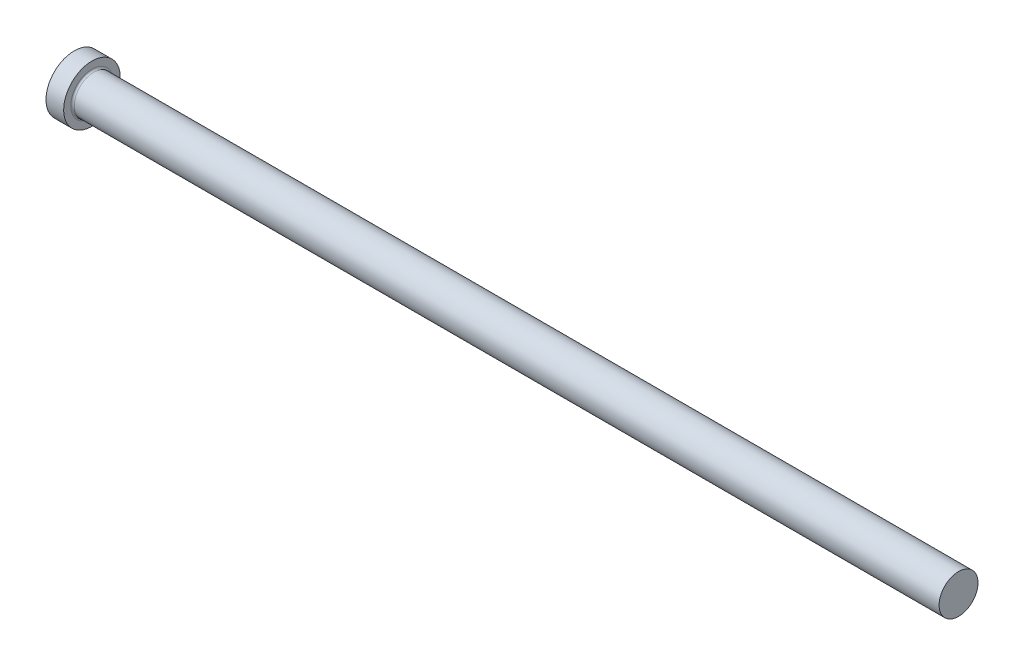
ISO-10303-21;
HEADER;
FILE_DESCRIPTION(('STEP AP214'),'2;1');
FILE_NAME('part.step','',(''),(''),'','','');
FILE_SCHEMA(('AUTOMOTIVE_DESIGN { 1 0 10303 214 1 1 1 1 }'));
ENDSEC;
DATA;
#1=APPLICATION_CONTEXT('core data for automotive mechanical design processes');
#2=APPLICATION_PROTOCOL_DEFINITION('international standard','automotive_design',2000,#1);
#3=PRODUCT_CONTEXT('',#1,'mechanical');
#4=PRODUCT('Part','Part','',(#3));
#5=PRODUCT_RELATED_PRODUCT_CATEGORY('part','',(#4));
#6=PRODUCT_DEFINITION_FORMATION('','',#4);
#7=PRODUCT_DEFINITION_CONTEXT('part definition',#1,'design');
#8=PRODUCT_DEFINITION('design','',#6,#7);
#9=PRODUCT_DEFINITION_SHAPE('','',#8);
#10=(LENGTH_UNIT() NAMED_UNIT(*) SI_UNIT(.MILLI.,.METRE.));
#11=(NAMED_UNIT(*) PLANE_ANGLE_UNIT() SI_UNIT($,.RADIAN.));
#12=(NAMED_UNIT(*) SI_UNIT($,.STERADIAN.) SOLID_ANGLE_UNIT());
#13=UNCERTAINTY_MEASURE_WITH_UNIT(LENGTH_MEASURE(1.E-05),#10,'distance_accuracy_value','');
#14=(GEOMETRIC_REPRESENTATION_CONTEXT(3) GLOBAL_UNCERTAINTY_ASSIGNED_CONTEXT((#13)) GLOBAL_UNIT_ASSIGNED_CONTEXT((#10,
#11,#12)) REPRESENTATION_CONTEXT('',''));
#15=CARTESIAN_POINT('',(0.,0.,0.));
#16=DIRECTION('',(0.,0.,1.));
#17=DIRECTION('',(1.,0.,0.));
#18=AXIS2_PLACEMENT_3D('',#15,#16,#17);
#19=CARTESIAN_POINT('',(0.,0.,0.));
#20=DIRECTION('',(-1.,0.,0.));
#21=DIRECTION('',(0.,-1.,0.));
#22=AXIS2_PLACEMENT_3D('',#19,#20,#21);
#23=PLANE('',#22);
#24=CARTESIAN_POINT('',(0.,0.,0.));
#25=DIRECTION('',(1.,0.,0.));
#26=DIRECTION('',(0.,1.,0.));
#27=AXIS2_PLACEMENT_3D('',#24,#25,#26);
#28=CIRCLE('',#27,8.);
#29=CARTESIAN_POINT('',(0.,8.,0.));
#30=VERTEX_POINT('',#29);
#31=EDGE_CURVE('E25',#30,#30,#28,.T.);
#32=ORIENTED_EDGE('',*,*,#31,.F.);
#33=EDGE_LOOP('',(#32));
#34=FACE_BOUND('',#33,.T.);
#35=ADVANCED_FACE('F14',(#34),#23,.T.);
#36=CARTESIAN_POINT('',(250.,0.,0.));
#37=DIRECTION('',(1.,0.,0.));
#38=DIRECTION('',(0.,1.,0.));
#39=AXIS2_PLACEMENT_3D('',#36,#37,#38);
#40=CYLINDRICAL_SURFACE('',#39,8.);
#41=ORIENTED_EDGE('',*,*,#31,.T.);
#42=EDGE_LOOP('',(#41));
#43=FACE_BOUND('',#42,.T.);
#44=CARTESIAN_POINT('',(5.,0.,0.));
#45=DIRECTION('',(1.,0.,0.));
#46=DIRECTION('',(0.,1.,0.));
#47=AXIS2_PLACEMENT_3D('',#44,#45,#46);
#48=CIRCLE('',#47,8.);
#49=CARTESIAN_POINT('',(5.,8.,0.));
#50=VERTEX_POINT('',#49);
#51=EDGE_CURVE('E29',#50,#50,#48,.T.);
#52=ORIENTED_EDGE('',*,*,#51,.F.);
#53=EDGE_LOOP('',(#52));
#54=FACE_BOUND('',#53,.T.);
#55=ADVANCED_FACE('F51',(#43,#54),#40,.T.);
#56=CARTESIAN_POINT('',(5.,8.,0.));
#57=DIRECTION('',(1.,0.,0.));
#58=DIRECTION('',(0.,1.,0.));
#59=AXIS2_PLACEMENT_3D('',#56,#57,#58);
#60=PLANE('',#59);
#61=CARTESIAN_POINT('',(5.,0.,0.));
#62=DIRECTION('',(1.,0.,0.));
#63=DIRECTION('',(0.,1.,0.));
#64=AXIS2_PLACEMENT_3D('',#61,#62,#63);
#65=CIRCLE('',#64,6.);
#66=CARTESIAN_POINT('',(5.,6.,0.));
#67=VERTEX_POINT('',#66);
#68=EDGE_CURVE('E9',#67,#67,#65,.F.);
#69=ORIENTED_EDGE('',*,*,#68,.T.);
#70=EDGE_LOOP('',(#69));
#71=FACE_BOUND('',#70,.T.);
#72=ORIENTED_EDGE('',*,*,#51,.T.);
#73=EDGE_LOOP('',(#72));
#74=FACE_BOUND('',#73,.T.);
#75=ADVANCED_FACE('F42',(#71,#74),#60,.T.);
#76=CARTESIAN_POINT('',(250.,0.,0.));
#77=DIRECTION('',(1.,0.,0.));
#78=DIRECTION('',(0.,1.,0.));
#79=AXIS2_PLACEMENT_3D('',#76,#77,#78);
#80=CYLINDRICAL_SURFACE('',#79,5.49999999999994);
#81=CARTESIAN_POINT('',(5.5,0.,0.));
#82=DIRECTION('',(1.,0.,0.));
#83=DIRECTION('',(0.,1.,0.));
#84=AXIS2_PLACEMENT_3D('',#81,#82,#83);
#85=CIRCLE('',#84,5.49999999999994);
#86=CARTESIAN_POINT('',(5.5,5.49999999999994,0.));
#87=VERTEX_POINT('',#86);
#88=EDGE_CURVE('E21',#87,#87,#85,.T.);
#89=ORIENTED_EDGE('',*,*,#88,.T.);
#90=EDGE_LOOP('',(#89));
#91=FACE_BOUND('',#90,.T.);
#92=CARTESIAN_POINT('',(250.,0.,0.));
#93=DIRECTION('',(1.,0.,0.));
#94=DIRECTION('',(0.,1.,0.));
#95=AXIS2_PLACEMENT_3D('',#92,#93,#94);
#96=CIRCLE('',#95,5.5);
#97=CARTESIAN_POINT('',(250.,5.50000000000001,0.));
#98=VERTEX_POINT('',#97);
#99=EDGE_CURVE('E34',#98,#98,#96,.T.);
#100=ORIENTED_EDGE('',*,*,#99,.F.);
#101=EDGE_LOOP('',(#100));
#102=FACE_BOUND('',#101,.T.);
#103=ADVANCED_FACE('F40',(#91,#102),#80,.T.);
#104=CARTESIAN_POINT('',(250.,5.5,0.));
#105=DIRECTION('',(1.,0.,0.));
#106=DIRECTION('',(0.,1.,0.));
#107=AXIS2_PLACEMENT_3D('',#104,#105,#106);
#108=PLANE('',#107);
#109=ORIENTED_EDGE('',*,*,#99,.T.);
#110=EDGE_LOOP('',(#109));
#111=FACE_BOUND('',#110,.T.);
#112=ADVANCED_FACE('F38',(#111),#108,.T.);
#113=CARTESIAN_POINT('',(5.5,0.,0.));
#114=DIRECTION('',(1.,0.,0.));
#115=DIRECTION('',(0.,1.,0.));
#116=AXIS2_PLACEMENT_3D('',#113,#114,#115);
#117=TOROIDAL_SURFACE('',#116,6.,0.5);
#118=ORIENTED_EDGE('',*,*,#68,.F.);
#119=EDGE_LOOP('',(#118));
#120=FACE_BOUND('',#119,.T.);
#121=ORIENTED_EDGE('',*,*,#88,.F.);
#122=EDGE_LOOP('',(#121));
#123=FACE_BOUND('',#122,.T.);
#124=ADVANCED_FACE('F16',(#120,#123),#117,.F.);
#125=CLOSED_SHELL('',(#35,#55,#75,#103,#112,#124));
#126=MANIFOLD_SOLID_BREP('B1',#125);
#127=ADVANCED_BREP_SHAPE_REPRESENTATION('',(#18,#126),#14);
#128=SHAPE_DEFINITION_REPRESENTATION(#9,#127);
ENDSEC;
END-ISO-10303-21;
